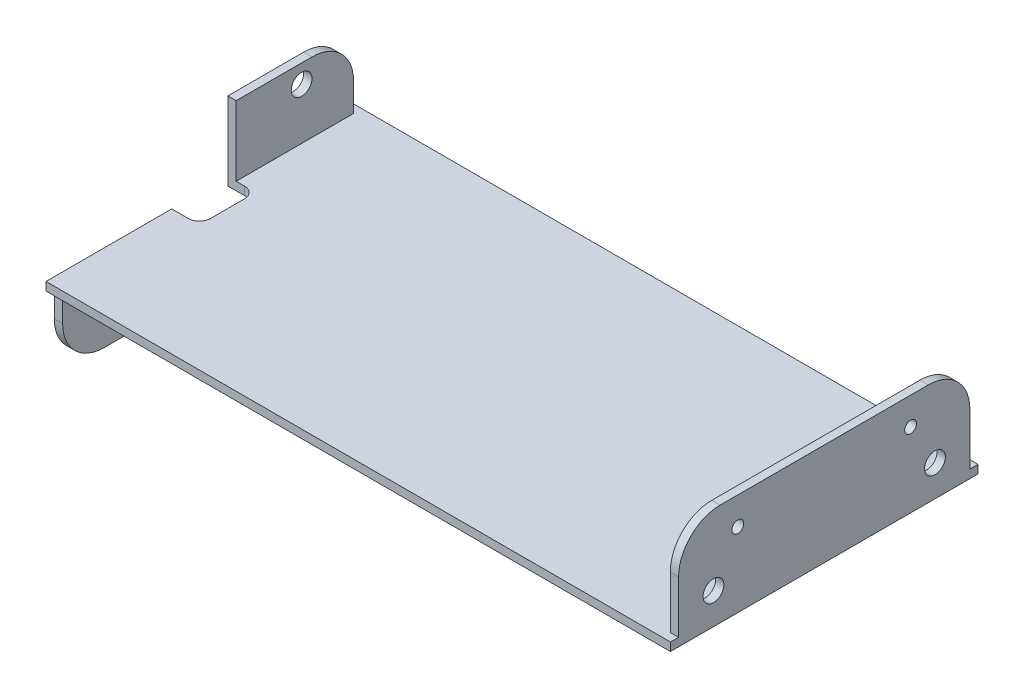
ISO-10303-21;
HEADER;
FILE_DESCRIPTION(('STEP AP214'),'2;1');
FILE_NAME('part.step','',(''),(''),'','','');
FILE_SCHEMA(('AUTOMOTIVE_DESIGN { 1 0 10303 214 1 1 1 1 }'));
ENDSEC;
DATA;
#1=APPLICATION_CONTEXT('core data for automotive mechanical design processes');
#2=APPLICATION_PROTOCOL_DEFINITION('international standard','automotive_design',2000,#1);
#3=PRODUCT_CONTEXT('',#1,'mechanical');
#4=PRODUCT('Part','Part','',(#3));
#5=PRODUCT_RELATED_PRODUCT_CATEGORY('part','',(#4));
#6=PRODUCT_DEFINITION_FORMATION('','',#4);
#7=PRODUCT_DEFINITION_CONTEXT('part definition',#1,'design');
#8=PRODUCT_DEFINITION('design','',#6,#7);
#9=PRODUCT_DEFINITION_SHAPE('','',#8);
#10=(LENGTH_UNIT() NAMED_UNIT(*) SI_UNIT(.MILLI.,.METRE.));
#11=(NAMED_UNIT(*) PLANE_ANGLE_UNIT() SI_UNIT($,.RADIAN.));
#12=(NAMED_UNIT(*) SI_UNIT($,.STERADIAN.) SOLID_ANGLE_UNIT());
#13=UNCERTAINTY_MEASURE_WITH_UNIT(LENGTH_MEASURE(1.E-05),#10,'distance_accuracy_value','');
#14=(GEOMETRIC_REPRESENTATION_CONTEXT(3) GLOBAL_UNCERTAINTY_ASSIGNED_CONTEXT((#13)) GLOBAL_UNIT_ASSIGNED_CONTEXT((#10,
#11,#12)) REPRESENTATION_CONTEXT('',''));
#15=CARTESIAN_POINT('',(0.,0.,0.));
#16=DIRECTION('',(0.,0.,1.));
#17=DIRECTION('',(1.,0.,0.));
#18=AXIS2_PLACEMENT_3D('',#15,#16,#17);
#19=CARTESIAN_POINT('',(143.2052,1.905,0.));
#20=DIRECTION('',(-1.,0.,0.));
#21=DIRECTION('',(0.,0.,1.));
#22=AXIS2_PLACEMENT_3D('',#19,#20,#21);
#23=PLANE('',#22);
#24=CARTESIAN_POINT('',(143.2052,17.0688,-15.4559));
#25=DIRECTION('',(1.,0.,0.));
#26=DIRECTION('',(0.,0.,-1.));
#27=AXIS2_PLACEMENT_3D('',#24,#25,#26);
#28=CIRCLE('',#27,1.35254999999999);
#29=CARTESIAN_POINT('',(143.2052,17.0688,-16.80845));
#30=VERTEX_POINT('',#29);
#31=EDGE_CURVE('E821',#30,#30,#28,.T.);
#32=ORIENTED_EDGE('',*,*,#31,.F.);
#33=EDGE_LOOP('',(#32));
#34=FACE_BOUND('',#33,.T.);
#35=DIRECTION('',(0.,-1.,0.));
#36=VECTOR('',#35,1.);
#37=CARTESIAN_POINT('',(143.2052,23.3934,-68.6689));
#38=LINE('',#37,#36);
#39=CARTESIAN_POINT('',(143.2052,13.8684,-68.6689));
#40=VERTEX_POINT('',#39);
#41=CARTESIAN_POINT('',(143.2052,1.905,-68.6689));
#42=VERTEX_POINT('',#41);
#43=EDGE_CURVE('E372',#40,#42,#38,.T.);
#44=ORIENTED_EDGE('',*,*,#43,.F.);
#45=CARTESIAN_POINT('',(143.2052,13.8684,-59.1439));
#46=DIRECTION('',(-1.,0.,0.));
#47=DIRECTION('',(0.,0.,1.));
#48=AXIS2_PLACEMENT_3D('',#45,#46,#47);
#49=CIRCLE('',#48,9.525);
#50=CARTESIAN_POINT('',(143.2052,23.3934,-59.1439));
#51=VERTEX_POINT('',#50);
#52=EDGE_CURVE('E285',#40,#51,#49,.F.);
#53=ORIENTED_EDGE('',*,*,#52,.T.);
#54=DIRECTION('',(0.,0.,-1.));
#55=VECTOR('',#54,1.);
#56=CARTESIAN_POINT('',(143.2052,23.3934,-1.8669));
#57=LINE('',#56,#55);
#58=CARTESIAN_POINT('',(143.2052,23.3934,-11.3919));
#59=VERTEX_POINT('',#58);
#60=EDGE_CURVE('E360',#59,#51,#57,.T.);
#61=ORIENTED_EDGE('',*,*,#60,.F.);
#62=CARTESIAN_POINT('',(143.2052,13.8684,-11.3919));
#63=DIRECTION('',(-1.,0.,0.));
#64=DIRECTION('',(0.,0.,1.));
#65=AXIS2_PLACEMENT_3D('',#62,#63,#64);
#66=CIRCLE('',#65,9.525);
#67=CARTESIAN_POINT('',(143.2052,13.8684,-1.8669));
#68=VERTEX_POINT('',#67);
#69=EDGE_CURVE('E283',#59,#68,#66,.F.);
#70=ORIENTED_EDGE('',*,*,#69,.T.);
#71=DIRECTION('',(0.,-1.,0.));
#72=VECTOR('',#71,1.);
#73=CARTESIAN_POINT('',(143.2052,23.3934,-1.8669));
#74=LINE('',#73,#72);
#75=CARTESIAN_POINT('',(143.2052,1.905,-1.8669));
#76=VERTEX_POINT('',#75);
#77=EDGE_CURVE('E276',#68,#76,#74,.T.);
#78=ORIENTED_EDGE('',*,*,#77,.T.);
#79=DIRECTION('',(0.,0.,-1.));
#80=VECTOR('',#79,1.);
#81=CARTESIAN_POINT('',(143.2052,1.905,0.));
#82=LINE('',#81,#80);
#83=CARTESIAN_POINT('',(143.2052,1.905,0.));
#84=VERTEX_POINT('',#83);
#85=EDGE_CURVE('E246',#84,#76,#82,.T.);
#86=ORIENTED_EDGE('',*,*,#85,.F.);
#87=DIRECTION('',(0.,-1.,0.));
#88=VECTOR('',#87,1.);
#89=CARTESIAN_POINT('',(143.2052,1.905,0.));
#90=LINE('',#89,#88);
#91=CARTESIAN_POINT('',(143.2052,0.,0.));
#92=VERTEX_POINT('',#91);
#93=EDGE_CURVE('E251',#84,#92,#90,.T.);
#94=ORIENTED_EDGE('',*,*,#93,.T.);
#95=DIRECTION('',(0.,0.,-1.));
#96=VECTOR('',#95,1.);
#97=CARTESIAN_POINT('',(143.2052,0.,0.));
#98=LINE('',#97,#96);
#99=CARTESIAN_POINT('',(143.2052,0.,-70.5358));
#100=VERTEX_POINT('',#99);
#101=EDGE_CURVE('E230',#92,#100,#98,.T.);
#102=ORIENTED_EDGE('',*,*,#101,.T.);
#103=DIRECTION('',(0.,-1.,0.));
#104=VECTOR('',#103,1.);
#105=CARTESIAN_POINT('',(143.2052,1.905,-70.5358));
#106=LINE('',#105,#104);
#107=CARTESIAN_POINT('',(143.2052,1.905,-70.5358));
#108=VERTEX_POINT('',#107);
#109=EDGE_CURVE('E254',#108,#100,#106,.T.);
#110=ORIENTED_EDGE('',*,*,#109,.F.);
#111=EDGE_CURVE('E237',#42,#108,#82,.T.);
#112=ORIENTED_EDGE('',*,*,#111,.F.);
#113=EDGE_LOOP('',(#44,#53,#61,#70,#78,#86,#94,#102,#110,#112));
#114=FACE_BOUND('',#113,.T.);
#115=CARTESIAN_POINT('',(143.2052,7.1628,-9.8679));
#116=DIRECTION('',(1.,0.,0.));
#117=DIRECTION('',(0.,0.,-1.));
#118=AXIS2_PLACEMENT_3D('',#115,#116,#117);
#119=CIRCLE('',#118,2.38125);
#120=CARTESIAN_POINT('',(143.2052,7.1628,-12.24915));
#121=VERTEX_POINT('',#120);
#122=EDGE_CURVE('E804',#121,#121,#119,.T.);
#123=ORIENTED_EDGE('',*,*,#122,.F.);
#124=EDGE_LOOP('',(#123));
#125=FACE_BOUND('',#124,.T.);
#126=CARTESIAN_POINT('',(143.2052,7.1628,-60.6679));
#127=DIRECTION('',(1.,0.,0.));
#128=DIRECTION('',(0.,0.,-1.));
#129=AXIS2_PLACEMENT_3D('',#126,#127,#128);
#130=CIRCLE('',#129,2.38125000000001);
#131=CARTESIAN_POINT('',(143.2052,7.1628,-63.04915));
#132=VERTEX_POINT('',#131);
#133=EDGE_CURVE('E810',#132,#132,#130,.T.);
#134=ORIENTED_EDGE('',*,*,#133,.F.);
#135=EDGE_LOOP('',(#134));
#136=FACE_BOUND('',#135,.T.);
#137=CARTESIAN_POINT('',(143.2052,17.0688,-55.0799));
#138=DIRECTION('',(1.,0.,0.));
#139=DIRECTION('',(0.,0.,-1.));
#140=AXIS2_PLACEMENT_3D('',#137,#138,#139);
#141=CIRCLE('',#140,1.35254999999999);
#142=CARTESIAN_POINT('',(143.2052,17.0688,-56.43245));
#143=VERTEX_POINT('',#142);
#144=EDGE_CURVE('E816',#143,#143,#141,.T.);
#145=ORIENTED_EDGE('',*,*,#144,.F.);
#146=EDGE_LOOP('',(#145));
#147=FACE_BOUND('',#146,.T.);
#148=ADVANCED_FACE('F39',(#34,#114,#125,#136,#147),#23,.F.);
#149=CARTESIAN_POINT('',(0.,1.905,0.));
#150=DIRECTION('',(1.,0.,0.));
#151=DIRECTION('',(0.,0.,-1.));
#152=AXIS2_PLACEMENT_3D('',#149,#150,#151);
#153=PLANE('',#152);
#154=CARTESIAN_POINT('',(0.,-9.2075,-16.0782));
#155=DIRECTION('',(-1.,0.,0.));
#156=DIRECTION('',(0.,0.,1.));
#157=AXIS2_PLACEMENT_3D('',#154,#155,#156);
#158=CIRCLE('',#157,2.38125);
#159=CARTESIAN_POINT('',(0.,-9.2075,-13.69695));
#160=VERTEX_POINT('',#159);
#161=EDGE_CURVE('E497',#160,#160,#158,.T.);
#162=ORIENTED_EDGE('',*,*,#161,.F.);
#163=EDGE_LOOP('',(#162));
#164=FACE_BOUND('',#163,.T.);
#165=DIRECTION('',(0.,0.,-1.));
#166=VECTOR('',#165,1.);
#167=CARTESIAN_POINT('',(0.,-16.002,-1.905));
#168=LINE('',#167,#166);
#169=CARTESIAN_POINT('',(0.,-16.002,-11.43));
#170=VERTEX_POINT('',#169);
#171=CARTESIAN_POINT('',(0.,-16.002,-28.829));
#172=VERTEX_POINT('',#171);
#173=EDGE_CURVE('E503',#170,#172,#168,.T.);
#174=ORIENTED_EDGE('',*,*,#173,.F.);
#175=CARTESIAN_POINT('',(0.,-6.477,-11.43));
#176=DIRECTION('',(1.,0.,0.));
#177=DIRECTION('',(0.,0.,-1.));
#178=AXIS2_PLACEMENT_3D('',#175,#176,#177);
#179=CIRCLE('',#178,9.525);
#180=CARTESIAN_POINT('',(0.,-6.477,-1.905));
#181=VERTEX_POINT('',#180);
#182=EDGE_CURVE('E515',#170,#181,#179,.F.);
#183=ORIENTED_EDGE('',*,*,#182,.T.);
#184=DIRECTION('',(0.,1.,0.));
#185=VECTOR('',#184,1.);
#186=CARTESIAN_POINT('',(0.,-16.002,-1.905));
#187=LINE('',#186,#185);
#188=CARTESIAN_POINT('',(0.,0.,-1.905));
#189=VERTEX_POINT('',#188);
#190=EDGE_CURVE('E333',#181,#189,#187,.T.);
#191=ORIENTED_EDGE('',*,*,#190,.T.);
#192=DIRECTION('',(0.,0.,1.));
#193=VECTOR('',#192,1.);
#194=CARTESIAN_POINT('',(0.,0.,0.));
#195=LINE('',#194,#193);
#196=CARTESIAN_POINT('',(0.,0.,0.));
#197=VERTEX_POINT('',#196);
#198=EDGE_CURVE('E266',#189,#197,#195,.T.);
#199=ORIENTED_EDGE('',*,*,#198,.T.);
#200=DIRECTION('',(0.,-1.,0.));
#201=VECTOR('',#200,1.);
#202=CARTESIAN_POINT('',(0.,1.905,0.));
#203=LINE('',#202,#201);
#204=CARTESIAN_POINT('',(0.,1.905,0.));
#205=VERTEX_POINT('',#204);
#206=EDGE_CURVE('E224',#205,#197,#203,.T.);
#207=ORIENTED_EDGE('',*,*,#206,.F.);
#208=DIRECTION('',(0.,0.,1.));
#209=VECTOR('',#208,1.);
#210=CARTESIAN_POINT('',(0.,1.905,0.));
#211=LINE('',#210,#209);
#212=CARTESIAN_POINT('',(0.,1.905,-28.829));
#213=VERTEX_POINT('',#212);
#214=EDGE_CURVE('E202',#213,#205,#211,.T.);
#215=ORIENTED_EDGE('',*,*,#214,.F.);
#216=DIRECTION('',(0.,1.,0.));
#217=VECTOR('',#216,1.);
#218=CARTESIAN_POINT('',(0.,-16.002,-28.829));
#219=LINE('',#218,#217);
#220=EDGE_CURVE('E212',#172,#213,#219,.T.);
#221=ORIENTED_EDGE('',*,*,#220,.F.);
#222=EDGE_LOOP('',(#174,#183,#191,#199,#207,#215,#221));
#223=FACE_BOUND('',#222,.T.);
#224=ADVANCED_FACE('F222',(#164,#223),#153,.F.);
#225=CARTESIAN_POINT('',(0.,1.905,0.));
#226=DIRECTION('',(0.,-1.,0.));
#227=DIRECTION('',(0.,0.,-1.));
#228=AXIS2_PLACEMENT_3D('',#225,#226,#227);
#229=PLANE('',#228);
#230=DIRECTION('',(0.,0.,-1.));
#231=VECTOR('',#230,1.);
#232=CARTESIAN_POINT('',(6.35,1.905,-28.829));
#233=LINE('',#232,#231);
#234=CARTESIAN_POINT('',(6.35,1.905,-31.369));
#235=VERTEX_POINT('',#234);
#236=CARTESIAN_POINT('',(6.35,1.905,-39.1668));
#237=VERTEX_POINT('',#236);
#238=EDGE_CURVE('E312',#235,#237,#233,.T.);
#239=ORIENTED_EDGE('',*,*,#238,.F.);
#240=CARTESIAN_POINT('',(3.81,1.905,-31.369));
#241=DIRECTION('',(0.,-1.,0.));
#242=DIRECTION('',(0.,0.,-1.));
#243=AXIS2_PLACEMENT_3D('',#240,#241,#242);
#244=CIRCLE('',#243,2.54);
#245=CARTESIAN_POINT('',(3.81,1.905,-28.829));
#246=VERTEX_POINT('',#245);
#247=EDGE_CURVE('E204',#235,#246,#244,.T.);
#248=ORIENTED_EDGE('',*,*,#247,.T.);
#249=DIRECTION('',(-1.,0.,0.));
#250=VECTOR('',#249,1.);
#251=CARTESIAN_POINT('',(6.35,1.905,-28.829));
#252=LINE('',#251,#250);
#253=EDGE_CURVE('E197',#246,#213,#252,.T.);
#254=ORIENTED_EDGE('',*,*,#253,.T.);
#255=ORIENTED_EDGE('',*,*,#214,.T.);
#256=DIRECTION('',(1.,0.,0.));
#257=VECTOR('',#256,1.);
#258=CARTESIAN_POINT('',(0.,1.905,0.));
#259=LINE('',#258,#257);
#260=EDGE_CURVE('E229',#205,#84,#259,.T.);
#261=ORIENTED_EDGE('',*,*,#260,.T.);
#262=ORIENTED_EDGE('',*,*,#85,.T.);
#263=DIRECTION('',(1.,0.,0.));
#264=VECTOR('',#263,1.);
#265=CARTESIAN_POINT('',(143.2052,1.905,-1.8669));
#266=LINE('',#265,#264);
#267=CARTESIAN_POINT('',(141.3002,1.905,-1.8669));
#268=VERTEX_POINT('',#267);
#269=EDGE_CURVE('E272',#268,#76,#266,.T.);
#270=ORIENTED_EDGE('',*,*,#269,.F.);
#271=DIRECTION('',(0.,0.,1.));
#272=VECTOR('',#271,1.);
#273=CARTESIAN_POINT('',(141.3002,1.905,-1.8669));
#274=LINE('',#273,#272);
#275=CARTESIAN_POINT('',(141.3002,1.905,-68.6689));
#276=VERTEX_POINT('',#275);
#277=EDGE_CURVE('E365',#276,#268,#274,.T.);
#278=ORIENTED_EDGE('',*,*,#277,.F.);
#279=DIRECTION('',(-1.,0.,0.));
#280=VECTOR('',#279,1.);
#281=CARTESIAN_POINT('',(143.2052,1.905,-68.6689));
#282=LINE('',#281,#280);
#283=EDGE_CURVE('E359',#42,#276,#282,.T.);
#284=ORIENTED_EDGE('',*,*,#283,.F.);
#285=ORIENTED_EDGE('',*,*,#111,.T.);
#286=DIRECTION('',(-1.,0.,0.));
#287=VECTOR('',#286,1.);
#288=CARTESIAN_POINT('',(0.,1.905,-70.5358));
#289=LINE('',#288,#287);
#290=CARTESIAN_POINT('',(0.,1.905,-70.5358));
#291=VERTEX_POINT('',#290);
#292=EDGE_CURVE('E240',#108,#291,#289,.T.);
#293=ORIENTED_EDGE('',*,*,#292,.T.);
#294=CARTESIAN_POINT('',(0.,1.905,-68.6308));
#295=VERTEX_POINT('',#294);
#296=EDGE_CURVE('E225',#291,#295,#211,.T.);
#297=ORIENTED_EDGE('',*,*,#296,.T.);
#298=DIRECTION('',(-1.,0.,0.));
#299=VECTOR('',#298,1.);
#300=CARTESIAN_POINT('',(0.,1.905,-68.6308));
#301=LINE('',#300,#299);
#302=CARTESIAN_POINT('',(1.905,1.905,-68.6308));
#303=VERTEX_POINT('',#302);
#304=EDGE_CURVE('E340',#303,#295,#301,.T.);
#305=ORIENTED_EDGE('',*,*,#304,.F.);
#306=DIRECTION('',(0.,0.,-1.));
#307=VECTOR('',#306,1.);
#308=CARTESIAN_POINT('',(1.905,1.905,-68.6308));
#309=LINE('',#308,#307);
#310=CARTESIAN_POINT('',(1.905,1.905,-41.7068));
#311=VERTEX_POINT('',#310);
#312=EDGE_CURVE('E218',#311,#303,#309,.T.);
#313=ORIENTED_EDGE('',*,*,#312,.F.);
#314=DIRECTION('',(-1.,0.,0.));
#315=VECTOR('',#314,1.);
#316=CARTESIAN_POINT('',(6.35,1.905,-41.7068));
#317=LINE('',#316,#315);
#318=CARTESIAN_POINT('',(3.81,1.905,-41.7068));
#319=VERTEX_POINT('',#318);
#320=EDGE_CURVE('E207',#319,#311,#317,.T.);
#321=ORIENTED_EDGE('',*,*,#320,.F.);
#322=CARTESIAN_POINT('',(3.81,1.905,-39.1668));
#323=DIRECTION('',(0.,-1.,0.));
#324=DIRECTION('',(0.,0.,-1.));
#325=AXIS2_PLACEMENT_3D('',#322,#323,#324);
#326=CIRCLE('',#325,2.54);
#327=EDGE_CURVE('E11',#319,#237,#326,.T.);
#328=ORIENTED_EDGE('',*,*,#327,.T.);
#329=EDGE_LOOP('',(#239,#248,#254,#255,#261,#262,#270,#278,#284,#285,#293,#297,#305,#313,#321,#328));
#330=FACE_BOUND('',#329,.T.);
#331=ADVANCED_FACE('F200',(#330),#229,.F.);
#332=CARTESIAN_POINT('',(0.,13.6525,-56.7182));
#333=DIRECTION('',(-1.,0.,0.));
#334=DIRECTION('',(0.,0.,1.));
#335=AXIS2_PLACEMENT_3D('',#332,#333,#334);
#336=CIRCLE('',#335,2.38125);
#337=CARTESIAN_POINT('',(0.,13.6525,-54.33695));
#338=VERTEX_POINT('',#337);
#339=EDGE_CURVE('E794',#338,#338,#336,.T.);
#340=ORIENTED_EDGE('',*,*,#339,.F.);
#341=EDGE_LOOP('',(#340));
#342=FACE_BOUND('',#341,.T.);
#343=DIRECTION('',(0.,0.,1.));
#344=VECTOR('',#343,1.);
#345=CARTESIAN_POINT('',(0.,17.907,-68.6308));
#346=LINE('',#345,#344);
#347=CARTESIAN_POINT('',(0.,17.907,-59.1058));
#348=VERTEX_POINT('',#347);
#349=CARTESIAN_POINT('',(0.,17.907,-41.7068));
#350=VERTEX_POINT('',#349);
#351=EDGE_CURVE('E337',#348,#350,#346,.T.);
#352=ORIENTED_EDGE('',*,*,#351,.F.);
#353=CARTESIAN_POINT('',(0.,8.382,-59.1058));
#354=DIRECTION('',(1.,0.,0.));
#355=DIRECTION('',(0.,0.,-1.));
#356=AXIS2_PLACEMENT_3D('',#353,#354,#355);
#357=CIRCLE('',#356,9.525);
#358=CARTESIAN_POINT('',(0.,8.382,-68.6308));
#359=VERTEX_POINT('',#358);
#360=EDGE_CURVE('E424',#348,#359,#357,.F.);
#361=ORIENTED_EDGE('',*,*,#360,.T.);
#362=DIRECTION('',(0.,-1.,0.));
#363=VECTOR('',#362,1.);
#364=CARTESIAN_POINT('',(0.,17.907,-68.6308));
#365=LINE('',#364,#363);
#366=EDGE_CURVE('E345',#359,#295,#365,.T.);
#367=ORIENTED_EDGE('',*,*,#366,.T.);
#368=ORIENTED_EDGE('',*,*,#296,.F.);
#369=DIRECTION('',(0.,-1.,0.));
#370=VECTOR('',#369,1.);
#371=CARTESIAN_POINT('',(0.,1.905,-70.5358));
#372=LINE('',#371,#370);
#373=CARTESIAN_POINT('',(0.,0.,-70.5358));
#374=VERTEX_POINT('',#373);
#375=EDGE_CURVE('E257',#291,#374,#372,.T.);
#376=ORIENTED_EDGE('',*,*,#375,.T.);
#377=CARTESIAN_POINT('',(0.,0.,-41.7068));
#378=VERTEX_POINT('',#377);
#379=EDGE_CURVE('E262',#374,#378,#195,.T.);
#380=ORIENTED_EDGE('',*,*,#379,.T.);
#381=DIRECTION('',(0.,-1.,0.));
#382=VECTOR('',#381,1.);
#383=CARTESIAN_POINT('',(0.,17.907,-41.7068));
#384=LINE('',#383,#382);
#385=EDGE_CURVE('E356',#350,#378,#384,.T.);
#386=ORIENTED_EDGE('',*,*,#385,.F.);
#387=EDGE_LOOP('',(#352,#361,#367,#368,#376,#380,#386));
#388=FACE_BOUND('',#387,.T.);
#389=ADVANCED_FACE('F465',(#342,#388),#153,.F.);
#390=CARTESIAN_POINT('',(0.,1.905,0.));
#391=DIRECTION('',(0.,0.,-1.));
#392=DIRECTION('',(-1.,0.,0.));
#393=AXIS2_PLACEMENT_3D('',#390,#391,#392);
#394=PLANE('',#393);
#395=DIRECTION('',(1.,0.,0.));
#396=VECTOR('',#395,1.);
#397=CARTESIAN_POINT('',(0.,0.,0.));
#398=LINE('',#397,#396);
#399=EDGE_CURVE('E261',#197,#92,#398,.T.);
#400=ORIENTED_EDGE('',*,*,#399,.T.);
#401=ORIENTED_EDGE('',*,*,#93,.F.);
#402=ORIENTED_EDGE('',*,*,#260,.F.);
#403=ORIENTED_EDGE('',*,*,#206,.T.);
#404=EDGE_LOOP('',(#400,#401,#402,#403));
#405=FACE_BOUND('',#404,.T.);
#406=ADVANCED_FACE('F470',(#405),#394,.F.);
#407=CARTESIAN_POINT('',(0.,1.905,-70.5358));
#408=DIRECTION('',(0.,0.,1.));
#409=DIRECTION('',(1.,0.,0.));
#410=AXIS2_PLACEMENT_3D('',#407,#408,#409);
#411=PLANE('',#410);
#412=DIRECTION('',(-1.,0.,0.));
#413=VECTOR('',#412,1.);
#414=CARTESIAN_POINT('',(0.,0.,-70.5358));
#415=LINE('',#414,#413);
#416=EDGE_CURVE('E226',#100,#374,#415,.T.);
#417=ORIENTED_EDGE('',*,*,#416,.T.);
#418=ORIENTED_EDGE('',*,*,#375,.F.);
#419=ORIENTED_EDGE('',*,*,#292,.F.);
#420=ORIENTED_EDGE('',*,*,#109,.T.);
#421=EDGE_LOOP('',(#417,#418,#419,#420));
#422=FACE_BOUND('',#421,.T.);
#423=ADVANCED_FACE('F398',(#422),#411,.F.);
#424=CARTESIAN_POINT('',(0.,0.,0.));
#425=DIRECTION('',(0.,-1.,0.));
#426=DIRECTION('',(0.,0.,-1.));
#427=AXIS2_PLACEMENT_3D('',#424,#425,#426);
#428=PLANE('',#427);
#429=DIRECTION('',(-1.,0.,0.));
#430=VECTOR('',#429,1.);
#431=CARTESIAN_POINT('',(6.35,0.,-28.829));
#432=LINE('',#431,#430);
#433=CARTESIAN_POINT('',(3.81,0.,-28.829));
#434=VERTEX_POINT('',#433);
#435=CARTESIAN_POINT('',(1.905,0.,-28.829));
#436=VERTEX_POINT('',#435);
#437=EDGE_CURVE('E305',#434,#436,#432,.T.);
#438=ORIENTED_EDGE('',*,*,#437,.F.);
#439=CARTESIAN_POINT('',(3.81,0.,-31.369));
#440=DIRECTION('',(0.,-1.,0.));
#441=DIRECTION('',(0.,0.,-1.));
#442=AXIS2_PLACEMENT_3D('',#439,#440,#441);
#443=CIRCLE('',#442,2.54);
#444=CARTESIAN_POINT('',(6.35,0.,-31.369));
#445=VERTEX_POINT('',#444);
#446=EDGE_CURVE('E299',#434,#445,#443,.F.);
#447=ORIENTED_EDGE('',*,*,#446,.T.);
#448=DIRECTION('',(0.,0.,1.));
#449=VECTOR('',#448,1.);
#450=CARTESIAN_POINT('',(6.35,0.,-28.829));
#451=LINE('',#450,#449);
#452=CARTESIAN_POINT('',(6.35,0.,-39.1668));
#453=VERTEX_POINT('',#452);
#454=EDGE_CURVE('E208',#453,#445,#451,.T.);
#455=ORIENTED_EDGE('',*,*,#454,.F.);
#456=CARTESIAN_POINT('',(3.81,0.,-39.1668));
#457=DIRECTION('',(0.,-1.,0.));
#458=DIRECTION('',(0.,0.,-1.));
#459=AXIS2_PLACEMENT_3D('',#456,#457,#458);
#460=CIRCLE('',#459,2.54);
#461=CARTESIAN_POINT('',(3.81,0.,-41.7068));
#462=VERTEX_POINT('',#461);
#463=EDGE_CURVE('E47',#453,#462,#460,.F.);
#464=ORIENTED_EDGE('',*,*,#463,.T.);
#465=DIRECTION('',(-1.,0.,0.));
#466=VECTOR('',#465,1.);
#467=CARTESIAN_POINT('',(6.35,0.,-41.7068));
#468=LINE('',#467,#466);
#469=EDGE_CURVE('E318',#462,#378,#468,.T.);
#470=ORIENTED_EDGE('',*,*,#469,.T.);
#471=ORIENTED_EDGE('',*,*,#379,.F.);
#472=ORIENTED_EDGE('',*,*,#416,.F.);
#473=ORIENTED_EDGE('',*,*,#101,.F.);
#474=ORIENTED_EDGE('',*,*,#399,.F.);
#475=ORIENTED_EDGE('',*,*,#198,.F.);
#476=DIRECTION('',(-1.,0.,0.));
#477=VECTOR('',#476,1.);
#478=CARTESIAN_POINT('',(0.,0.,-1.905));
#479=LINE('',#478,#477);
#480=CARTESIAN_POINT('',(1.905,0.,-1.905));
#481=VERTEX_POINT('',#480);
#482=EDGE_CURVE('E324',#481,#189,#479,.T.);
#483=ORIENTED_EDGE('',*,*,#482,.F.);
#484=DIRECTION('',(0.,0.,1.));
#485=VECTOR('',#484,1.);
#486=CARTESIAN_POINT('',(1.905,0.,-1.905));
#487=LINE('',#486,#485);
#488=EDGE_CURVE('E317',#436,#481,#487,.T.);
#489=ORIENTED_EDGE('',*,*,#488,.F.);
#490=EDGE_LOOP('',(#438,#447,#455,#464,#470,#471,#472,#473,#474,#475,#483,#489));
#491=FACE_BOUND('',#490,.T.);
#492=ADVANCED_FACE('F303',(#491),#428,.T.);
#493=CARTESIAN_POINT('',(143.2052,23.3934,-68.6689));
#494=DIRECTION('',(0.,0.,1.));
#495=DIRECTION('',(1.,0.,0.));
#496=AXIS2_PLACEMENT_3D('',#493,#494,#495);
#497=PLANE('',#496);
#498=DIRECTION('',(0.,-1.,0.));
#499=VECTOR('',#498,1.);
#500=CARTESIAN_POINT('',(141.3002,23.3934,-68.6689));
#501=LINE('',#500,#499);
#502=CARTESIAN_POINT('',(141.3002,13.8684,-68.6689));
#503=VERTEX_POINT('',#502);
#504=EDGE_CURVE('E234',#503,#276,#501,.T.);
#505=ORIENTED_EDGE('',*,*,#504,.F.);
#506=DIRECTION('',(-1.,0.,0.));
#507=VECTOR('',#506,1.);
#508=CARTESIAN_POINT('',(143.2052,13.8684,-68.6689));
#509=LINE('',#508,#507);
#510=EDGE_CURVE('E281',#503,#40,#509,.F.);
#511=ORIENTED_EDGE('',*,*,#510,.T.);
#512=ORIENTED_EDGE('',*,*,#43,.T.);
#513=ORIENTED_EDGE('',*,*,#283,.T.);
#514=EDGE_LOOP('',(#505,#511,#512,#513));
#515=FACE_BOUND('',#514,.T.);
#516=ADVANCED_FACE('F386',(#515),#497,.F.);
#517=CARTESIAN_POINT('',(141.3002,23.3934,-1.8669));
#518=DIRECTION('',(1.,0.,0.));
#519=DIRECTION('',(0.,0.,-1.));
#520=AXIS2_PLACEMENT_3D('',#517,#518,#519);
#521=PLANE('',#520);
#522=CARTESIAN_POINT('',(141.3002,17.0688,-15.4559));
#523=DIRECTION('',(1.,0.,0.));
#524=DIRECTION('',(0.,0.,-1.));
#525=AXIS2_PLACEMENT_3D('',#522,#523,#524);
#526=CIRCLE('',#525,1.35254999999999);
#527=CARTESIAN_POINT('',(141.3002,17.0688,-16.80845));
#528=VERTEX_POINT('',#527);
#529=EDGE_CURVE('E819',#528,#528,#526,.T.);
#530=ORIENTED_EDGE('',*,*,#529,.T.);
#531=EDGE_LOOP('',(#530));
#532=FACE_BOUND('',#531,.T.);
#533=CARTESIAN_POINT('',(141.3002,17.0688,-55.0799));
#534=DIRECTION('',(1.,0.,0.));
#535=DIRECTION('',(0.,0.,-1.));
#536=AXIS2_PLACEMENT_3D('',#533,#534,#535);
#537=CIRCLE('',#536,1.35254999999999);
#538=CARTESIAN_POINT('',(141.3002,17.0688,-56.43245));
#539=VERTEX_POINT('',#538);
#540=EDGE_CURVE('E813',#539,#539,#537,.T.);
#541=ORIENTED_EDGE('',*,*,#540,.T.);
#542=EDGE_LOOP('',(#541));
#543=FACE_BOUND('',#542,.T.);
#544=CARTESIAN_POINT('',(141.3002,7.1628,-60.6679));
#545=DIRECTION('',(1.,0.,0.));
#546=DIRECTION('',(0.,0.,-1.));
#547=AXIS2_PLACEMENT_3D('',#544,#545,#546);
#548=CIRCLE('',#547,2.38125000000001);
#549=CARTESIAN_POINT('',(141.3002,7.1628,-63.04915));
#550=VERTEX_POINT('',#549);
#551=EDGE_CURVE('E807',#550,#550,#548,.F.);
#552=ORIENTED_EDGE('',*,*,#551,.F.);
#553=EDGE_LOOP('',(#552));
#554=FACE_BOUND('',#553,.T.);
#555=CARTESIAN_POINT('',(141.3002,7.1628,-9.8679));
#556=DIRECTION('',(1.,0.,0.));
#557=DIRECTION('',(0.,0.,-1.));
#558=AXIS2_PLACEMENT_3D('',#555,#556,#557);
#559=CIRCLE('',#558,2.38125);
#560=CARTESIAN_POINT('',(141.3002,7.1628,-12.24915));
#561=VERTEX_POINT('',#560);
#562=EDGE_CURVE('E801',#561,#561,#559,.F.);
#563=ORIENTED_EDGE('',*,*,#562,.F.);
#564=EDGE_LOOP('',(#563));
#565=FACE_BOUND('',#564,.T.);
#566=DIRECTION('',(0.,0.,1.));
#567=VECTOR('',#566,1.);
#568=CARTESIAN_POINT('',(141.3002,23.3934,-1.8669));
#569=LINE('',#568,#567);
#570=CARTESIAN_POINT('',(141.3002,23.3934,-59.1439));
#571=VERTEX_POINT('',#570);
#572=CARTESIAN_POINT('',(141.3002,23.3934,-11.3919));
#573=VERTEX_POINT('',#572);
#574=EDGE_CURVE('E280',#571,#573,#569,.T.);
#575=ORIENTED_EDGE('',*,*,#574,.F.);
#576=CARTESIAN_POINT('',(141.3002,13.8684,-59.1439));
#577=DIRECTION('',(1.,0.,0.));
#578=DIRECTION('',(0.,0.,-1.));
#579=AXIS2_PLACEMENT_3D('',#576,#577,#578);
#580=CIRCLE('',#579,9.525);
#581=EDGE_CURVE('E381',#571,#503,#580,.F.);
#582=ORIENTED_EDGE('',*,*,#581,.T.);
#583=ORIENTED_EDGE('',*,*,#504,.T.);
#584=ORIENTED_EDGE('',*,*,#277,.T.);
#585=DIRECTION('',(0.,-1.,0.));
#586=VECTOR('',#585,1.);
#587=CARTESIAN_POINT('',(141.3002,23.3934,-1.8669));
#588=LINE('',#587,#586);
#589=CARTESIAN_POINT('',(141.3002,13.8684,-1.8669));
#590=VERTEX_POINT('',#589);
#591=EDGE_CURVE('E279',#590,#268,#588,.T.);
#592=ORIENTED_EDGE('',*,*,#591,.F.);
#593=CARTESIAN_POINT('',(141.3002,13.8684,-11.3919));
#594=DIRECTION('',(1.,0.,0.));
#595=DIRECTION('',(0.,0.,-1.));
#596=AXIS2_PLACEMENT_3D('',#593,#594,#595);
#597=CIRCLE('',#596,9.525);
#598=EDGE_CURVE('E429',#590,#573,#597,.F.);
#599=ORIENTED_EDGE('',*,*,#598,.T.);
#600=EDGE_LOOP('',(#575,#582,#583,#584,#592,#599));
#601=FACE_BOUND('',#600,.T.);
#602=ADVANCED_FACE('F445',(#532,#543,#554,#565,#601),#521,.F.);
#603=CARTESIAN_POINT('',(143.2052,23.3934,-1.8669));
#604=DIRECTION('',(0.,0.,-1.));
#605=DIRECTION('',(-1.,0.,0.));
#606=AXIS2_PLACEMENT_3D('',#603,#604,#605);
#607=PLANE('',#606);
#608=ORIENTED_EDGE('',*,*,#77,.F.);
#609=DIRECTION('',(1.,0.,0.));
#610=VECTOR('',#609,1.);
#611=CARTESIAN_POINT('',(141.3002,13.8684,-1.8669));
#612=LINE('',#611,#610);
#613=EDGE_CURVE('E287',#68,#590,#612,.F.);
#614=ORIENTED_EDGE('',*,*,#613,.T.);
#615=ORIENTED_EDGE('',*,*,#591,.T.);
#616=ORIENTED_EDGE('',*,*,#269,.T.);
#617=EDGE_LOOP('',(#608,#614,#615,#616));
#618=FACE_BOUND('',#617,.T.);
#619=ADVANCED_FACE('F444',(#618),#607,.F.);
#620=CARTESIAN_POINT('',(0.,23.3934,0.));
#621=DIRECTION('',(0.,1.,0.));
#622=DIRECTION('',(0.,0.,1.));
#623=AXIS2_PLACEMENT_3D('',#620,#621,#622);
#624=PLANE('',#623);
#625=ORIENTED_EDGE('',*,*,#60,.T.);
#626=DIRECTION('',(-1.,0.,0.));
#627=VECTOR('',#626,1.);
#628=CARTESIAN_POINT('',(141.3002,23.3934,-59.1439));
#629=LINE('',#628,#627);
#630=EDGE_CURVE('E422',#51,#571,#629,.T.);
#631=ORIENTED_EDGE('',*,*,#630,.T.);
#632=ORIENTED_EDGE('',*,*,#574,.T.);
#633=DIRECTION('',(1.,0.,0.));
#634=VECTOR('',#633,1.);
#635=CARTESIAN_POINT('',(143.2052,23.3934,-11.3919));
#636=LINE('',#635,#634);
#637=EDGE_CURVE('E419',#573,#59,#636,.T.);
#638=ORIENTED_EDGE('',*,*,#637,.T.);
#639=EDGE_LOOP('',(#625,#631,#632,#638));
#640=FACE_BOUND('',#639,.T.);
#641=ADVANCED_FACE('F437',(#640),#624,.T.);
#642=CARTESIAN_POINT('',(0.,17.907,-41.7068));
#643=DIRECTION('',(0.,0.,-1.));
#644=DIRECTION('',(-1.,0.,0.));
#645=AXIS2_PLACEMENT_3D('',#642,#643,#644);
#646=PLANE('',#645);
#647=ORIENTED_EDGE('',*,*,#469,.F.);
#648=DIRECTION('',(0.,-1.,0.));
#649=VECTOR('',#648,1.);
#650=CARTESIAN_POINT('',(3.81,17.907,-41.7068));
#651=LINE('',#650,#649);
#652=EDGE_CURVE('E54',#462,#319,#651,.F.);
#653=ORIENTED_EDGE('',*,*,#652,.T.);
#654=ORIENTED_EDGE('',*,*,#320,.T.);
#655=DIRECTION('',(0.,-1.,0.));
#656=VECTOR('',#655,1.);
#657=CARTESIAN_POINT('',(1.905,17.907,-41.7068));
#658=LINE('',#657,#656);
#659=CARTESIAN_POINT('',(1.905,17.907,-41.7068));
#660=VERTEX_POINT('',#659);
#661=EDGE_CURVE('E353',#660,#311,#658,.T.);
#662=ORIENTED_EDGE('',*,*,#661,.F.);
#663=DIRECTION('',(1.,0.,0.));
#664=VECTOR('',#663,1.);
#665=CARTESIAN_POINT('',(0.,17.907,-41.7068));
#666=LINE('',#665,#664);
#667=EDGE_CURVE('E339',#350,#660,#666,.T.);
#668=ORIENTED_EDGE('',*,*,#667,.F.);
#669=ORIENTED_EDGE('',*,*,#385,.T.);
#670=EDGE_LOOP('',(#647,#653,#654,#662,#668,#669));
#671=FACE_BOUND('',#670,.T.);
#672=ADVANCED_FACE('F527',(#671),#646,.F.);
#673=CARTESIAN_POINT('',(1.905,17.907,-68.6308));
#674=DIRECTION('',(-1.,0.,0.));
#675=DIRECTION('',(0.,0.,1.));
#676=AXIS2_PLACEMENT_3D('',#673,#674,#675);
#677=PLANE('',#676);
#678=CARTESIAN_POINT('',(1.90499999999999,13.6525,-56.7182));
#679=DIRECTION('',(-1.,0.,0.));
#680=DIRECTION('',(0.,0.,1.));
#681=AXIS2_PLACEMENT_3D('',#678,#679,#680);
#682=CIRCLE('',#681,2.38125);
#683=CARTESIAN_POINT('',(1.90499999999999,13.6525,-54.33695));
#684=VERTEX_POINT('',#683);
#685=EDGE_CURVE('E796',#684,#684,#682,.F.);
#686=ORIENTED_EDGE('',*,*,#685,.F.);
#687=EDGE_LOOP('',(#686));
#688=FACE_BOUND('',#687,.T.);
#689=DIRECTION('',(0.,-1.,0.));
#690=VECTOR('',#689,1.);
#691=CARTESIAN_POINT('',(1.905,17.907,-68.6308));
#692=LINE('',#691,#690);
#693=CARTESIAN_POINT('',(1.905,8.382,-68.6308));
#694=VERTEX_POINT('',#693);
#695=EDGE_CURVE('E351',#694,#303,#692,.T.);
#696=ORIENTED_EDGE('',*,*,#695,.F.);
#697=CARTESIAN_POINT('',(1.905,8.382,-59.1058));
#698=DIRECTION('',(-1.,0.,0.));
#699=DIRECTION('',(0.,0.,1.));
#700=AXIS2_PLACEMENT_3D('',#697,#698,#699);
#701=CIRCLE('',#700,9.525);
#702=CARTESIAN_POINT('',(1.905,17.907,-59.1058));
#703=VERTEX_POINT('',#702);
#704=EDGE_CURVE('E413',#694,#703,#701,.F.);
#705=ORIENTED_EDGE('',*,*,#704,.T.);
#706=DIRECTION('',(0.,0.,-1.));
#707=VECTOR('',#706,1.);
#708=CARTESIAN_POINT('',(1.905,17.907,-68.6308));
#709=LINE('',#708,#707);
#710=EDGE_CURVE('E342',#660,#703,#709,.T.);
#711=ORIENTED_EDGE('',*,*,#710,.F.);
#712=ORIENTED_EDGE('',*,*,#661,.T.);
#713=ORIENTED_EDGE('',*,*,#312,.T.);
#714=EDGE_LOOP('',(#696,#705,#711,#712,#713));
#715=FACE_BOUND('',#714,.T.);
#716=ADVANCED_FACE('F411',(#688,#715),#677,.F.);
#717=CARTESIAN_POINT('',(0.,17.907,-68.6308));
#718=DIRECTION('',(0.,0.,1.));
#719=DIRECTION('',(1.,0.,0.));
#720=AXIS2_PLACEMENT_3D('',#717,#718,#719);
#721=PLANE('',#720);
#722=ORIENTED_EDGE('',*,*,#366,.F.);
#723=DIRECTION('',(-1.,0.,0.));
#724=VECTOR('',#723,1.);
#725=CARTESIAN_POINT('',(1.905,8.382,-68.6308));
#726=LINE('',#725,#724);
#727=EDGE_CURVE('E408',#359,#694,#726,.F.);
#728=ORIENTED_EDGE('',*,*,#727,.T.);
#729=ORIENTED_EDGE('',*,*,#695,.T.);
#730=ORIENTED_EDGE('',*,*,#304,.T.);
#731=EDGE_LOOP('',(#722,#728,#729,#730));
#732=FACE_BOUND('',#731,.T.);
#733=ADVANCED_FACE('F405',(#732),#721,.F.);
#734=CARTESIAN_POINT('',(0.,17.907,0.));
#735=DIRECTION('',(0.,1.,0.));
#736=DIRECTION('',(0.,0.,1.));
#737=AXIS2_PLACEMENT_3D('',#734,#735,#736);
#738=PLANE('',#737);
#739=ORIENTED_EDGE('',*,*,#710,.T.);
#740=DIRECTION('',(-1.,0.,0.));
#741=VECTOR('',#740,1.);
#742=CARTESIAN_POINT('',(0.,17.907,-59.1058));
#743=LINE('',#742,#741);
#744=EDGE_CURVE('E418',#703,#348,#743,.T.);
#745=ORIENTED_EDGE('',*,*,#744,.T.);
#746=ORIENTED_EDGE('',*,*,#351,.T.);
#747=ORIENTED_EDGE('',*,*,#667,.T.);
#748=EDGE_LOOP('',(#739,#745,#746,#747));
#749=FACE_BOUND('',#748,.T.);
#750=ADVANCED_FACE('F524',(#749),#738,.T.);
#751=CARTESIAN_POINT('',(0.,-16.002,-28.829));
#752=DIRECTION('',(0.,0.,1.));
#753=DIRECTION('',(1.,0.,0.));
#754=AXIS2_PLACEMENT_3D('',#751,#752,#753);
#755=PLANE('',#754);
#756=ORIENTED_EDGE('',*,*,#253,.F.);
#757=DIRECTION('',(0.,1.,0.));
#758=VECTOR('',#757,1.);
#759=CARTESIAN_POINT('',(3.81,-16.002,-28.829));
#760=LINE('',#759,#758);
#761=EDGE_CURVE('E295',#246,#434,#760,.F.);
#762=ORIENTED_EDGE('',*,*,#761,.T.);
#763=ORIENTED_EDGE('',*,*,#437,.T.);
#764=DIRECTION('',(0.,1.,0.));
#765=VECTOR('',#764,1.);
#766=CARTESIAN_POINT('',(1.905,-16.002,-28.829));
#767=LINE('',#766,#765);
#768=CARTESIAN_POINT('',(1.905,-16.002,-28.829));
#769=VERTEX_POINT('',#768);
#770=EDGE_CURVE('E219',#769,#436,#767,.T.);
#771=ORIENTED_EDGE('',*,*,#770,.F.);
#772=DIRECTION('',(1.,0.,0.));
#773=VECTOR('',#772,1.);
#774=CARTESIAN_POINT('',(0.,-16.002,-28.829));
#775=LINE('',#774,#773);
#776=EDGE_CURVE('E215',#172,#769,#775,.T.);
#777=ORIENTED_EDGE('',*,*,#776,.F.);
#778=ORIENTED_EDGE('',*,*,#220,.T.);
#779=EDGE_LOOP('',(#756,#762,#763,#771,#777,#778));
#780=FACE_BOUND('',#779,.T.);
#781=ADVANCED_FACE('F213',(#780),#755,.F.);
#782=CARTESIAN_POINT('',(1.905,-16.002,-1.905));
#783=DIRECTION('',(-1.,0.,0.));
#784=DIRECTION('',(0.,0.,1.));
#785=AXIS2_PLACEMENT_3D('',#782,#783,#784);
#786=PLANE('',#785);
#787=CARTESIAN_POINT('',(1.90499999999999,-9.2075,-16.0782));
#788=DIRECTION('',(-1.,0.,0.));
#789=DIRECTION('',(0.,0.,1.));
#790=AXIS2_PLACEMENT_3D('',#787,#788,#789);
#791=CIRCLE('',#790,2.38125);
#792=CARTESIAN_POINT('',(1.90499999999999,-9.2075,-13.69695));
#793=VERTEX_POINT('',#792);
#794=EDGE_CURVE('E494',#793,#793,#791,.F.);
#795=ORIENTED_EDGE('',*,*,#794,.F.);
#796=EDGE_LOOP('',(#795));
#797=FACE_BOUND('',#796,.T.);
#798=DIRECTION('',(0.,1.,0.));
#799=VECTOR('',#798,1.);
#800=CARTESIAN_POINT('',(1.905,-16.002,-1.905));
#801=LINE('',#800,#799);
#802=CARTESIAN_POINT('',(1.905,-6.477,-1.905));
#803=VERTEX_POINT('',#802);
#804=EDGE_CURVE('E331',#803,#481,#801,.T.);
#805=ORIENTED_EDGE('',*,*,#804,.F.);
#806=CARTESIAN_POINT('',(1.905,-6.477,-11.43));
#807=DIRECTION('',(-1.,0.,0.));
#808=DIRECTION('',(0.,0.,1.));
#809=AXIS2_PLACEMENT_3D('',#806,#807,#808);
#810=CIRCLE('',#809,9.525);
#811=CARTESIAN_POINT('',(1.905,-16.002,-11.43));
#812=VERTEX_POINT('',#811);
#813=EDGE_CURVE('E519',#803,#812,#810,.F.);
#814=ORIENTED_EDGE('',*,*,#813,.T.);
#815=DIRECTION('',(0.,0.,1.));
#816=VECTOR('',#815,1.);
#817=CARTESIAN_POINT('',(1.905,-16.002,-1.905));
#818=LINE('',#817,#816);
#819=EDGE_CURVE('E330',#769,#812,#818,.T.);
#820=ORIENTED_EDGE('',*,*,#819,.F.);
#821=ORIENTED_EDGE('',*,*,#770,.T.);
#822=ORIENTED_EDGE('',*,*,#488,.T.);
#823=EDGE_LOOP('',(#805,#814,#820,#821,#822));
#824=FACE_BOUND('',#823,.T.);
#825=ADVANCED_FACE('F328',(#797,#824),#786,.F.);
#826=CARTESIAN_POINT('',(0.,-16.002,-1.905));
#827=DIRECTION('',(0.,0.,-1.));
#828=DIRECTION('',(-1.,0.,0.));
#829=AXIS2_PLACEMENT_3D('',#826,#827,#828);
#830=PLANE('',#829);
#831=ORIENTED_EDGE('',*,*,#190,.F.);
#832=DIRECTION('',(-1.,0.,0.));
#833=VECTOR('',#832,1.);
#834=CARTESIAN_POINT('',(1.905,-6.477,-1.905));
#835=LINE('',#834,#833);
#836=EDGE_CURVE('E517',#181,#803,#835,.F.);
#837=ORIENTED_EDGE('',*,*,#836,.T.);
#838=ORIENTED_EDGE('',*,*,#804,.T.);
#839=ORIENTED_EDGE('',*,*,#482,.T.);
#840=EDGE_LOOP('',(#831,#837,#838,#839));
#841=FACE_BOUND('',#840,.T.);
#842=ADVANCED_FACE('F533',(#841),#830,.F.);
#843=CARTESIAN_POINT('',(0.,-16.002,0.));
#844=DIRECTION('',(0.,-1.,0.));
#845=DIRECTION('',(0.,0.,-1.));
#846=AXIS2_PLACEMENT_3D('',#843,#844,#845);
#847=PLANE('',#846);
#848=ORIENTED_EDGE('',*,*,#819,.T.);
#849=DIRECTION('',(-1.,0.,0.));
#850=VECTOR('',#849,1.);
#851=CARTESIAN_POINT('',(0.,-16.002,-11.43));
#852=LINE('',#851,#850);
#853=EDGE_CURVE('E250',#812,#170,#852,.T.);
#854=ORIENTED_EDGE('',*,*,#853,.T.);
#855=ORIENTED_EDGE('',*,*,#173,.T.);
#856=ORIENTED_EDGE('',*,*,#776,.T.);
#857=EDGE_LOOP('',(#848,#854,#855,#856));
#858=FACE_BOUND('',#857,.T.);
#859=ADVANCED_FACE('F539',(#858),#847,.T.);
#860=CARTESIAN_POINT('',(6.35,0.,0.));
#861=DIRECTION('',(-1.,0.,0.));
#862=DIRECTION('',(0.,0.,1.));
#863=AXIS2_PLACEMENT_3D('',#860,#861,#862);
#864=PLANE('',#863);
#865=ORIENTED_EDGE('',*,*,#454,.T.);
#866=DIRECTION('',(0.,1.,0.));
#867=VECTOR('',#866,1.);
#868=CARTESIAN_POINT('',(6.35,0.,-31.369));
#869=LINE('',#868,#867);
#870=EDGE_CURVE('E292',#445,#235,#869,.T.);
#871=ORIENTED_EDGE('',*,*,#870,.T.);
#872=ORIENTED_EDGE('',*,*,#238,.T.);
#873=DIRECTION('',(0.,-1.,0.));
#874=VECTOR('',#873,1.);
#875=CARTESIAN_POINT('',(6.35,0.,-39.1668));
#876=LINE('',#875,#874);
#877=EDGE_CURVE('E289',#237,#453,#876,.T.);
#878=ORIENTED_EDGE('',*,*,#877,.T.);
#879=EDGE_LOOP('',(#865,#871,#872,#878));
#880=FACE_BOUND('',#879,.T.);
#881=ADVANCED_FACE('F309',(#880),#864,.T.);
#882=CARTESIAN_POINT('',(143.20625,-9.2075,-16.0782));
#883=DIRECTION('',(-1.,0.,0.));
#884=DIRECTION('',(0.,0.,1.));
#885=AXIS2_PLACEMENT_3D('',#882,#883,#884);
#886=CYLINDRICAL_SURFACE('',#885,2.38125);
#887=ORIENTED_EDGE('',*,*,#161,.T.);
#888=EDGE_LOOP('',(#887));
#889=FACE_BOUND('',#888,.T.);
#890=ORIENTED_EDGE('',*,*,#794,.T.);
#891=EDGE_LOOP('',(#890));
#892=FACE_BOUND('',#891,.T.);
#893=ADVANCED_FACE('F546',(#889,#892),#886,.F.);
#894=CARTESIAN_POINT('',(143.20625,13.6525,-56.7182));
#895=DIRECTION('',(-1.,0.,0.));
#896=DIRECTION('',(0.,0.,1.));
#897=AXIS2_PLACEMENT_3D('',#894,#895,#896);
#898=CYLINDRICAL_SURFACE('',#897,2.38125);
#899=ORIENTED_EDGE('',*,*,#339,.T.);
#900=EDGE_LOOP('',(#899));
#901=FACE_BOUND('',#900,.T.);
#902=ORIENTED_EDGE('',*,*,#685,.T.);
#903=EDGE_LOOP('',(#902));
#904=FACE_BOUND('',#903,.T.);
#905=ADVANCED_FACE('F725',(#901,#904),#898,.F.);
#906=CARTESIAN_POINT('',(-0.00105000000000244,7.1628,-9.8679));
#907=DIRECTION('',(1.,0.,0.));
#908=DIRECTION('',(0.,0.,-1.));
#909=AXIS2_PLACEMENT_3D('',#906,#907,#908);
#910=CYLINDRICAL_SURFACE('',#909,2.38125);
#911=ORIENTED_EDGE('',*,*,#122,.T.);
#912=EDGE_LOOP('',(#911));
#913=FACE_BOUND('',#912,.T.);
#914=ORIENTED_EDGE('',*,*,#562,.T.);
#915=EDGE_LOOP('',(#914));
#916=FACE_BOUND('',#915,.T.);
#917=ADVANCED_FACE('F715',(#913,#916),#910,.F.);
#918=CARTESIAN_POINT('',(-0.00105000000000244,7.1628,-60.6679));
#919=DIRECTION('',(1.,0.,0.));
#920=DIRECTION('',(0.,0.,-1.));
#921=AXIS2_PLACEMENT_3D('',#918,#919,#920);
#922=CYLINDRICAL_SURFACE('',#921,2.38125000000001);
#923=ORIENTED_EDGE('',*,*,#133,.T.);
#924=EDGE_LOOP('',(#923));
#925=FACE_BOUND('',#924,.T.);
#926=ORIENTED_EDGE('',*,*,#551,.T.);
#927=EDGE_LOOP('',(#926));
#928=FACE_BOUND('',#927,.T.);
#929=ADVANCED_FACE('F705',(#925,#928),#922,.F.);
#930=CARTESIAN_POINT('',(143.2052,17.0688,-55.0799));
#931=DIRECTION('',(1.,0.,0.));
#932=DIRECTION('',(0.,0.,-1.));
#933=AXIS2_PLACEMENT_3D('',#930,#931,#932);
#934=CYLINDRICAL_SURFACE('',#933,1.35254999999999);
#935=ORIENTED_EDGE('',*,*,#540,.F.);
#936=EDGE_LOOP('',(#935));
#937=FACE_BOUND('',#936,.T.);
#938=ORIENTED_EDGE('',*,*,#144,.T.);
#939=EDGE_LOOP('',(#938));
#940=FACE_BOUND('',#939,.T.);
#941=ADVANCED_FACE('F695',(#937,#940),#934,.F.);
#942=CARTESIAN_POINT('',(143.2052,17.0688,-15.4559));
#943=DIRECTION('',(1.,0.,0.));
#944=DIRECTION('',(0.,0.,-1.));
#945=AXIS2_PLACEMENT_3D('',#942,#943,#944);
#946=CYLINDRICAL_SURFACE('',#945,1.35254999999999);
#947=ORIENTED_EDGE('',*,*,#529,.F.);
#948=EDGE_LOOP('',(#947));
#949=FACE_BOUND('',#948,.T.);
#950=ORIENTED_EDGE('',*,*,#31,.T.);
#951=EDGE_LOOP('',(#950));
#952=FACE_BOUND('',#951,.T.);
#953=ADVANCED_FACE('F479',(#949,#952),#946,.F.);
#954=CARTESIAN_POINT('',(0.,-6.477,-11.43));
#955=DIRECTION('',(1.,0.,0.));
#956=DIRECTION('',(0.,0.,-1.));
#957=AXIS2_PLACEMENT_3D('',#954,#955,#956);
#958=CYLINDRICAL_SURFACE('',#957,9.525);
#959=ORIENTED_EDGE('',*,*,#813,.F.);
#960=ORIENTED_EDGE('',*,*,#836,.F.);
#961=ORIENTED_EDGE('',*,*,#182,.F.);
#962=ORIENTED_EDGE('',*,*,#853,.F.);
#963=EDGE_LOOP('',(#959,#960,#961,#962));
#964=FACE_BOUND('',#963,.T.);
#965=ADVANCED_FACE('F476',(#964),#958,.T.);
#966=CARTESIAN_POINT('',(0.,8.382,-59.1058));
#967=DIRECTION('',(1.,0.,0.));
#968=DIRECTION('',(0.,0.,-1.));
#969=AXIS2_PLACEMENT_3D('',#966,#967,#968);
#970=CYLINDRICAL_SURFACE('',#969,9.525);
#971=ORIENTED_EDGE('',*,*,#704,.F.);
#972=ORIENTED_EDGE('',*,*,#727,.F.);
#973=ORIENTED_EDGE('',*,*,#360,.F.);
#974=ORIENTED_EDGE('',*,*,#744,.F.);
#975=EDGE_LOOP('',(#971,#972,#973,#974));
#976=FACE_BOUND('',#975,.T.);
#977=ADVANCED_FACE('F416',(#976),#970,.T.);
#978=CARTESIAN_POINT('',(0.,13.8684,-59.1439));
#979=DIRECTION('',(1.,0.,0.));
#980=DIRECTION('',(0.,0.,-1.));
#981=AXIS2_PLACEMENT_3D('',#978,#979,#980);
#982=CYLINDRICAL_SURFACE('',#981,9.525);
#983=ORIENTED_EDGE('',*,*,#52,.F.);
#984=ORIENTED_EDGE('',*,*,#510,.F.);
#985=ORIENTED_EDGE('',*,*,#581,.F.);
#986=ORIENTED_EDGE('',*,*,#630,.F.);
#987=EDGE_LOOP('',(#983,#984,#985,#986));
#988=FACE_BOUND('',#987,.T.);
#989=ADVANCED_FACE('F433',(#988),#982,.T.);
#990=CARTESIAN_POINT('',(0.,13.8684,-11.3919));
#991=DIRECTION('',(-1.,0.,0.));
#992=DIRECTION('',(0.,0.,1.));
#993=AXIS2_PLACEMENT_3D('',#990,#991,#992);
#994=CYLINDRICAL_SURFACE('',#993,9.525);
#995=ORIENTED_EDGE('',*,*,#598,.F.);
#996=ORIENTED_EDGE('',*,*,#613,.F.);
#997=ORIENTED_EDGE('',*,*,#69,.F.);
#998=ORIENTED_EDGE('',*,*,#637,.F.);
#999=EDGE_LOOP('',(#995,#996,#997,#998));
#1000=FACE_BOUND('',#999,.T.);
#1001=ADVANCED_FACE('F440',(#1000),#994,.T.);
#1002=CARTESIAN_POINT('',(3.81,0.,-31.369));
#1003=DIRECTION('',(0.,1.,0.));
#1004=DIRECTION('',(0.,0.,1.));
#1005=AXIS2_PLACEMENT_3D('',#1002,#1003,#1004);
#1006=CYLINDRICAL_SURFACE('',#1005,2.54);
#1007=ORIENTED_EDGE('',*,*,#446,.F.);
#1008=ORIENTED_EDGE('',*,*,#761,.F.);
#1009=ORIENTED_EDGE('',*,*,#247,.F.);
#1010=ORIENTED_EDGE('',*,*,#870,.F.);
#1011=EDGE_LOOP('',(#1007,#1008,#1009,#1010));
#1012=FACE_BOUND('',#1011,.T.);
#1013=ADVANCED_FACE('F314',(#1012),#1006,.F.);
#1014=CARTESIAN_POINT('',(3.81,0.,-39.1668));
#1015=DIRECTION('',(0.,-1.,0.));
#1016=DIRECTION('',(0.,0.,-1.));
#1017=AXIS2_PLACEMENT_3D('',#1014,#1015,#1016);
#1018=CYLINDRICAL_SURFACE('',#1017,2.54);
#1019=ORIENTED_EDGE('',*,*,#327,.F.);
#1020=ORIENTED_EDGE('',*,*,#652,.F.);
#1021=ORIENTED_EDGE('',*,*,#463,.F.);
#1022=ORIENTED_EDGE('',*,*,#877,.F.);
#1023=EDGE_LOOP('',(#1019,#1020,#1021,#1022));
#1024=FACE_BOUND('',#1023,.T.);
#1025=ADVANCED_FACE('F41',(#1024),#1018,.F.);
#1026=CLOSED_SHELL('',(#148,#224,#331,#389,#406,#423,#492,#516,#602,#619,#641,#672,#716,#733,
#750,#781,#825,#842,#859,#881,#893,#905,#917,#929,#941,#953,#965,#977,#989,#1001,#1013,#1025));
#1027=MANIFOLD_SOLID_BREP('B2',#1026);
#1028=ADVANCED_BREP_SHAPE_REPRESENTATION('',(#18,#1027),#14);
#1029=SHAPE_DEFINITION_REPRESENTATION(#9,#1028);
ENDSEC;
END-ISO-10303-21;
